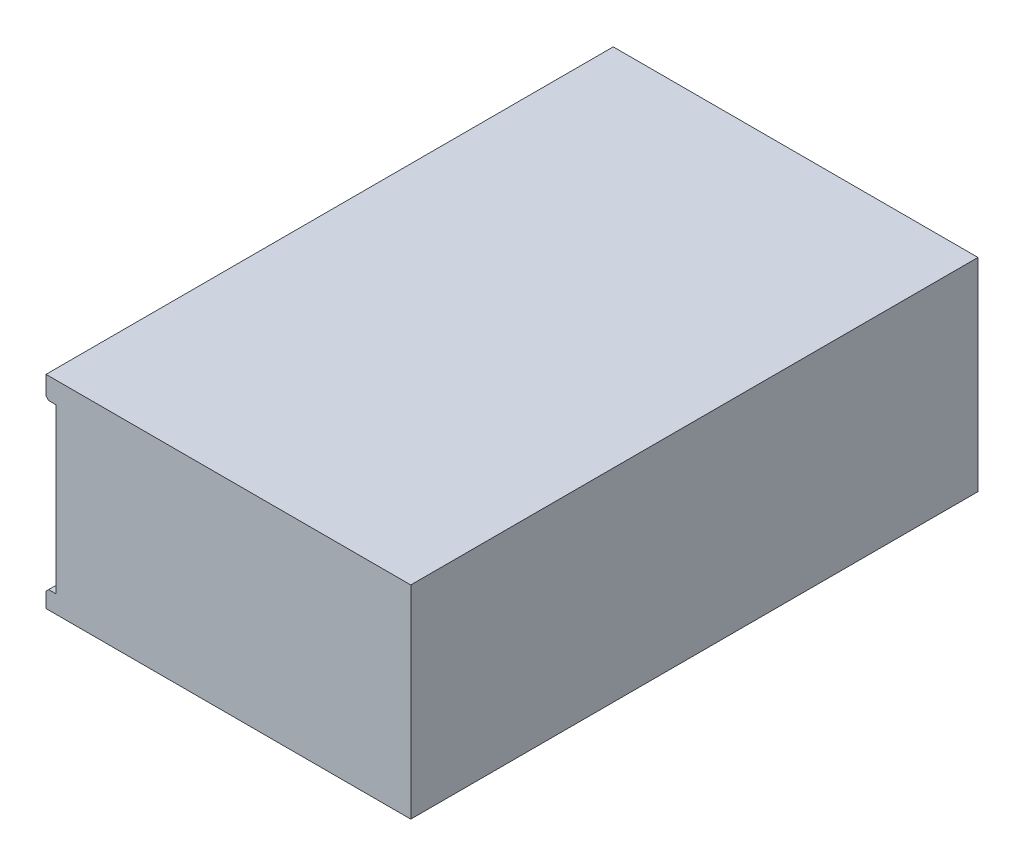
from build123d import *

# Parameters (mm, degrees)
EXTRUDE1_DEPTH                   = 40.4876
F_10_32_TAPPED_HOLE1_D           = 4.0386
F_10_32_TAPPED_HOLE1_DEPTH       = 9.99744
F_10_32_TAPPED_HOLE1_CBORE_D     = 4.826
F_10_32_TAPPED_HOLE1_CBORE_DEPTH = 7.62
F_10_32_TAPPED_HOLE1_TIP         = 1.213317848
CHAMFER1_SIZE                    = 0.381


with BuildPart() as part:
    # Sketch1 → Extrude1 (new, symmetric)
    with BuildSketch(Plane.XY):
        Polygon((50.673, 0), (50.673, -28.956), (-1.397, -28.956), (-1.397, -26.416), (0, -26.416), (0, -3.048), (-1.397, -3.048), (-1.397, 0), align=None)
    extrude(amount=EXTRUDE1_DEPTH, both=True)

    # 10-32 Tapped Hole1
    with Locations(Plane(origin=(0, -6.35, -35.179), x_dir=(0, 0, -1), z_dir=(-1, 0, 0))):
        with Locations((0, 0), (-70.358, 0), (0, 16.764), (-70.358, 16.764)):
            CounterBoreHole(F_10_32_TAPPED_HOLE1_D / 2, F_10_32_TAPPED_HOLE1_CBORE_D / 2, F_10_32_TAPPED_HOLE1_CBORE_DEPTH, depth=F_10_32_TAPPED_HOLE1_DEPTH)
            with Locations((0, 0, -(F_10_32_TAPPED_HOLE1_DEPTH + F_10_32_TAPPED_HOLE1_TIP / 2))):  # 118° drill point
                Cone(0, F_10_32_TAPPED_HOLE1_D / 2, F_10_32_TAPPED_HOLE1_TIP, mode=Mode.SUBTRACT)

    # Chamfer1
    chamfer1_edges = [part.edges().sort_by_distance(p)[0] for p in [
        (-1.397, -26.416, 0),
        (-1.397, -3.048, 0),
    ]]
    chamfer(chamfer1_edges, length=CHAMFER1_SIZE)


solid = part.part
